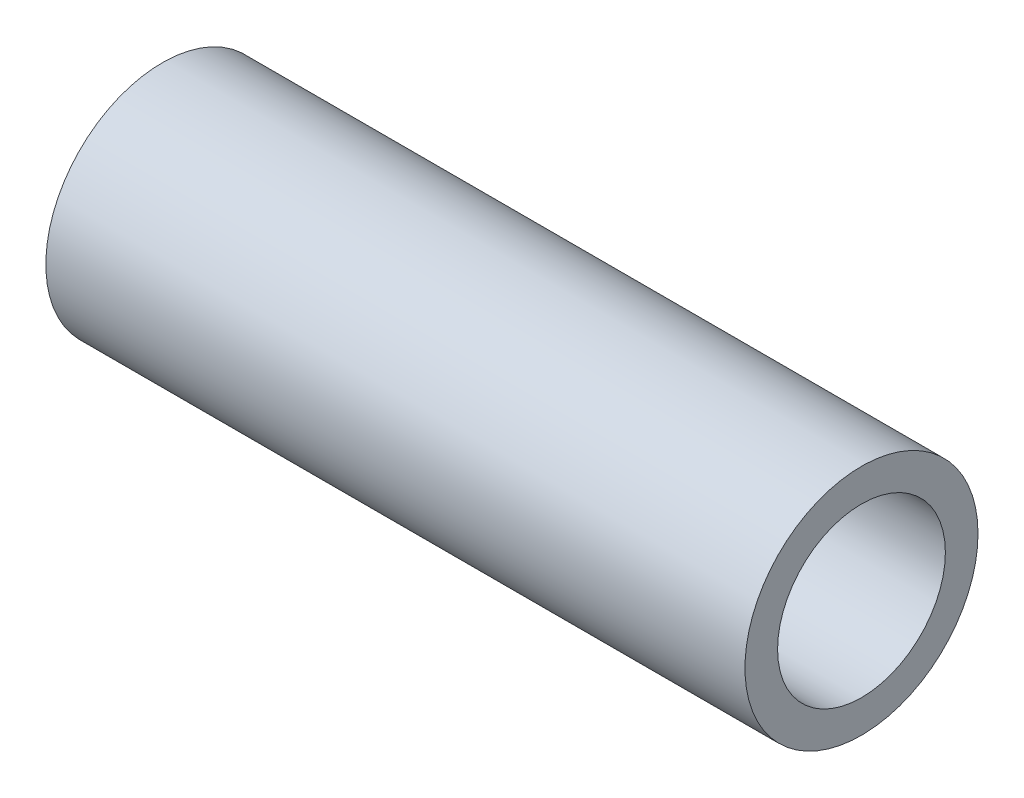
from build123d import *

# Parameters (mm, degrees)
SKETCH1_R          = 5
BASE_EXTRUDE_DEPTH = 30


with BuildPart() as part:
    # Sketch1 → Base-Extrude (new body)
    with BuildSketch(Plane(origin=(0, 0, 0), x_dir=(0, 0, -1), z_dir=(1, 0, 0))):
        Circle(SKETCH1_R)
    extrude(amount=BASE_EXTRUDE_DEPTH)

    # Sketch2 → Cut-Revolve1 (revolve, cut)
    with BuildSketch(Plane.XY, mode=Mode.PRIVATE) as cut_revolve1_sk:
        Polygon((30, 0), (30, 3.6), (23.35, 3.6), (20.734446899, 0), align=None)
        Polygon((9.265553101, 0), (0, 0), (0, 3.6), (6.65, 3.6), align=None)
    revolve(cut_revolve1_sk.sketch.rotate(Axis((-23.676963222, 0, 0), (1, 0, 0)), 180), axis=Axis((-23.676963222, 0, 0), (1, 0, 0)), mode=Mode.SUBTRACT)


solid = part.part
